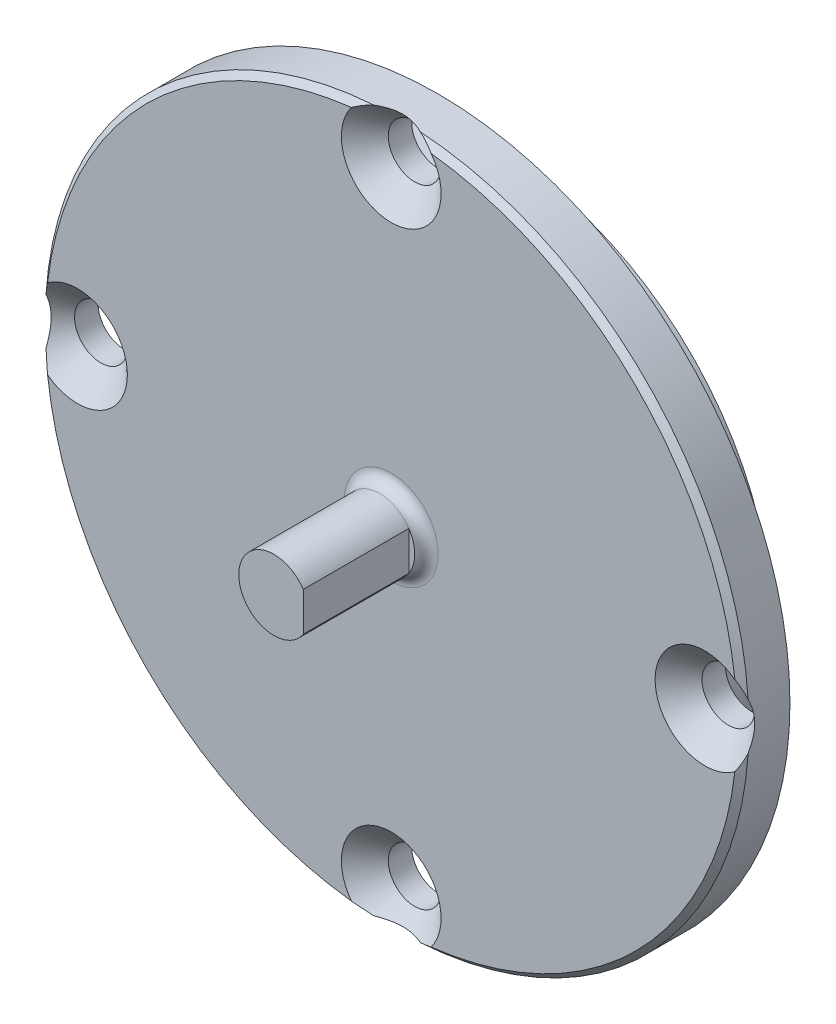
ISO-10303-21;
HEADER;
FILE_DESCRIPTION(('STEP AP214'),'2;1');
FILE_NAME('part.step','',(''),(''),'','','');
FILE_SCHEMA(('AUTOMOTIVE_DESIGN { 1 0 10303 214 1 1 1 1 }'));
ENDSEC;
DATA;
#1=APPLICATION_CONTEXT('core data for automotive mechanical design processes');
#2=APPLICATION_PROTOCOL_DEFINITION('international standard','automotive_design',2000,#1);
#3=PRODUCT_CONTEXT('',#1,'mechanical');
#4=PRODUCT('Part','Part','',(#3));
#5=PRODUCT_RELATED_PRODUCT_CATEGORY('part','',(#4));
#6=PRODUCT_DEFINITION_FORMATION('','',#4);
#7=PRODUCT_DEFINITION_CONTEXT('part definition',#1,'design');
#8=PRODUCT_DEFINITION('design','',#6,#7);
#9=PRODUCT_DEFINITION_SHAPE('','',#8);
#10=(LENGTH_UNIT() NAMED_UNIT(*) SI_UNIT(.MILLI.,.METRE.));
#11=(NAMED_UNIT(*) PLANE_ANGLE_UNIT() SI_UNIT($,.RADIAN.));
#12=(NAMED_UNIT(*) SI_UNIT($,.STERADIAN.) SOLID_ANGLE_UNIT());
#13=UNCERTAINTY_MEASURE_WITH_UNIT(LENGTH_MEASURE(1.E-05),#10,'distance_accuracy_value','');
#14=(GEOMETRIC_REPRESENTATION_CONTEXT(3) GLOBAL_UNCERTAINTY_ASSIGNED_CONTEXT((#13)) GLOBAL_UNIT_ASSIGNED_CONTEXT((#10,
#11,#12)) REPRESENTATION_CONTEXT('',''));
#15=CARTESIAN_POINT('',(0.,0.,0.));
#16=DIRECTION('',(0.,0.,1.));
#17=DIRECTION('',(1.,0.,0.));
#18=AXIS2_PLACEMENT_3D('',#15,#16,#17);
#19=CARTESIAN_POINT('',(0.,0.,4.));
#20=DIRECTION('',(0.,0.,1.));
#21=DIRECTION('',(1.,0.,0.));
#22=AXIS2_PLACEMENT_3D('',#19,#20,#21);
#23=PLANE('',#22);
#24=CARTESIAN_POINT('',(0.,0.,4.));
#25=DIRECTION('',(0.,0.,1.));
#26=DIRECTION('',(1.,0.,0.));
#27=AXIS2_PLACEMENT_3D('',#24,#25,#26);
#28=CIRCLE('',#27,4.);
#29=CARTESIAN_POINT('',(4.,0.,4.));
#30=VERTEX_POINT('',#29);
#31=EDGE_CURVE('E342',#30,#30,#28,.F.);
#32=ORIENTED_EDGE('',*,*,#31,.T.);
#33=EDGE_LOOP('',(#32));
#34=FACE_BOUND('',#33,.T.);
#35=CARTESIAN_POINT('',(0.,0.,4.));
#36=DIRECTION('',(0.,0.,1.));
#37=DIRECTION('',(1.,0.,0.));
#38=AXIS2_PLACEMENT_3D('',#35,#36,#37);
#39=CIRCLE('',#38,29.5);
#40=CARTESIAN_POINT('',(3.39719304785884,-29.303738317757,4.));
#41=VERTEX_POINT('',#40);
#42=CARTESIAN_POINT('',(29.303738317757,-3.39719304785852,4.));
#43=VERTEX_POINT('',#42);
#44=EDGE_CURVE('E121',#41,#43,#39,.T.);
#45=ORIENTED_EDGE('',*,*,#44,.T.);
#46=CARTESIAN_POINT('',(26.75,1.86641372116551E-13,4.));
#47=DIRECTION('',(0.,0.,1.));
#48=DIRECTION('',(1.,0.,0.));
#49=AXIS2_PLACEMENT_3D('',#46,#47,#48);
#50=CIRCLE('',#49,4.25);
#51=CARTESIAN_POINT('',(29.303738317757,3.39719304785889,4.));
#52=VERTEX_POINT('',#51);
#53=EDGE_CURVE('E44',#52,#43,#50,.T.);
#54=ORIENTED_EDGE('',*,*,#53,.F.);
#55=CARTESIAN_POINT('',(3.39719304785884,29.303738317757,4.));
#56=VERTEX_POINT('',#55);
#57=EDGE_CURVE('E118',#52,#56,#39,.T.);
#58=ORIENTED_EDGE('',*,*,#57,.T.);
#59=CARTESIAN_POINT('',(0.,26.75,4.));
#60=DIRECTION('',(0.,0.,1.));
#61=DIRECTION('',(1.,0.,0.));
#62=AXIS2_PLACEMENT_3D('',#59,#60,#61);
#63=CIRCLE('',#62,4.25);
#64=CARTESIAN_POINT('',(-3.39719304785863,29.303738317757,4.));
#65=VERTEX_POINT('',#64);
#66=EDGE_CURVE('E203',#65,#56,#63,.T.);
#67=ORIENTED_EDGE('',*,*,#66,.F.);
#68=CARTESIAN_POINT('',(-29.303738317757,3.39719304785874,4.));
#69=VERTEX_POINT('',#68);
#70=EDGE_CURVE('E129',#65,#69,#39,.T.);
#71=ORIENTED_EDGE('',*,*,#70,.T.);
#72=CARTESIAN_POINT('',(-26.75,0.,4.));
#73=DIRECTION('',(0.,0.,1.));
#74=DIRECTION('',(1.,0.,0.));
#75=AXIS2_PLACEMENT_3D('',#72,#73,#74);
#76=CIRCLE('',#75,4.25);
#77=CARTESIAN_POINT('',(-29.3037383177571,-3.39719304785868,4.));
#78=VERTEX_POINT('',#77);
#79=EDGE_CURVE('E143',#78,#69,#76,.T.);
#80=ORIENTED_EDGE('',*,*,#79,.F.);
#81=CARTESIAN_POINT('',(-3.39719304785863,-29.303738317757,4.));
#82=VERTEX_POINT('',#81);
#83=EDGE_CURVE('E130',#78,#82,#39,.T.);
#84=ORIENTED_EDGE('',*,*,#83,.T.);
#85=CARTESIAN_POINT('',(0.,-26.75,4.));
#86=DIRECTION('',(0.,0.,1.));
#87=DIRECTION('',(1.,0.,0.));
#88=AXIS2_PLACEMENT_3D('',#85,#86,#87);
#89=CIRCLE('',#88,4.25);
#90=EDGE_CURVE('E52',#41,#82,#89,.T.);
#91=ORIENTED_EDGE('',*,*,#90,.F.);
#92=EDGE_LOOP('',(#45,#54,#58,#67,#71,#80,#84,#91));
#93=FACE_BOUND('',#92,.T.);
#94=ADVANCED_FACE('F28',(#34,#93),#23,.T.);
#95=CARTESIAN_POINT('',(0.,0.,0.));
#96=DIRECTION('',(0.,0.,1.));
#97=DIRECTION('',(1.,0.,0.));
#98=AXIS2_PLACEMENT_3D('',#95,#96,#97);
#99=PLANE('',#98);
#100=CARTESIAN_POINT('',(0.,0.,0.));
#101=DIRECTION('',(0.,0.,1.));
#102=DIRECTION('',(1.,0.,0.));
#103=AXIS2_PLACEMENT_3D('',#100,#101,#102);
#104=CIRCLE('',#103,23.75);
#105=CARTESIAN_POINT('',(23.75,0.,0.));
#106=VERTEX_POINT('',#105);
#107=EDGE_CURVE('E11',#106,#106,#104,.T.);
#108=ORIENTED_EDGE('',*,*,#107,.T.);
#109=EDGE_LOOP('',(#108));
#110=FACE_BOUND('',#109,.T.);
#111=CARTESIAN_POINT('',(0.,-26.75,0.));
#112=DIRECTION('',(0.,0.,1.));
#113=DIRECTION('',(1.,0.,0.));
#114=AXIS2_PLACEMENT_3D('',#111,#112,#113);
#115=CIRCLE('',#114,2.25);
#116=CARTESIAN_POINT('',(2.25000000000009,-26.75,0.));
#117=VERTEX_POINT('',#116);
#118=EDGE_CURVE('E190',#117,#117,#115,.F.);
#119=ORIENTED_EDGE('',*,*,#118,.F.);
#120=EDGE_LOOP('',(#119));
#121=FACE_BOUND('',#120,.T.);
#122=CARTESIAN_POINT('',(0.,26.75,0.));
#123=DIRECTION('',(0.,0.,1.));
#124=DIRECTION('',(1.,0.,0.));
#125=AXIS2_PLACEMENT_3D('',#122,#123,#124);
#126=CIRCLE('',#125,2.25);
#127=CARTESIAN_POINT('',(2.25000000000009,26.75,0.));
#128=VERTEX_POINT('',#127);
#129=EDGE_CURVE('E224',#128,#128,#126,.F.);
#130=ORIENTED_EDGE('',*,*,#129,.F.);
#131=EDGE_LOOP('',(#130));
#132=FACE_BOUND('',#131,.T.);
#133=CARTESIAN_POINT('',(0.,0.,0.));
#134=DIRECTION('',(0.,0.,1.));
#135=DIRECTION('',(1.,0.,0.));
#136=AXIS2_PLACEMENT_3D('',#133,#134,#135);
#137=CIRCLE('',#136,30.);
#138=CARTESIAN_POINT('',(30.,0.,0.));
#139=VERTEX_POINT('',#138);
#140=EDGE_CURVE('E127',#139,#139,#137,.T.);
#141=ORIENTED_EDGE('',*,*,#140,.F.);
#142=EDGE_LOOP('',(#141));
#143=FACE_BOUND('',#142,.T.);
#144=CARTESIAN_POINT('',(-26.75,0.,0.));
#145=DIRECTION('',(0.,0.,1.));
#146=DIRECTION('',(1.,0.,0.));
#147=AXIS2_PLACEMENT_3D('',#144,#145,#146);
#148=CIRCLE('',#147,2.25);
#149=CARTESIAN_POINT('',(-24.5,0.,0.));
#150=VERTEX_POINT('',#149);
#151=EDGE_CURVE('E164',#150,#150,#148,.F.);
#152=ORIENTED_EDGE('',*,*,#151,.F.);
#153=EDGE_LOOP('',(#152));
#154=FACE_BOUND('',#153,.T.);
#155=CARTESIAN_POINT('',(26.75,1.86641372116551E-13,0.));
#156=DIRECTION('',(0.,0.,1.));
#157=DIRECTION('',(1.,0.,0.));
#158=AXIS2_PLACEMENT_3D('',#155,#156,#157);
#159=CIRCLE('',#158,2.25);
#160=CARTESIAN_POINT('',(29.,1.86641372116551E-13,0.));
#161=VERTEX_POINT('',#160);
#162=EDGE_CURVE('E361',#161,#161,#159,.F.);
#163=ORIENTED_EDGE('',*,*,#162,.F.);
#164=EDGE_LOOP('',(#163));
#165=FACE_BOUND('',#164,.T.);
#166=ADVANCED_FACE('F296',(#110,#121,#132,#143,#154,#165),#99,.F.);
#167=CARTESIAN_POINT('',(0.,0.,4.));
#168=DIRECTION('',(0.,0.,-1.));
#169=DIRECTION('',(-1.,0.,0.));
#170=AXIS2_PLACEMENT_3D('',#167,#168,#169);
#171=CYLINDRICAL_SURFACE('',#170,30.);
#172=ORIENTED_EDGE('',*,*,#140,.T.);
#173=EDGE_LOOP('',(#172));
#174=FACE_BOUND('',#173,.T.);
#175=CARTESIAN_POINT('',(29.9345514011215,-1.98056366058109,3.5002));
#176=CARTESIAN_POINT('',(29.9440210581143,-1.83742255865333,3.4327030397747));
#177=CARTESIAN_POINT('',(29.9526187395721,-1.6919002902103,3.36949670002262));
#178=CARTESIAN_POINT('',(29.9679024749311,-1.39535388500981,3.25470355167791));
#179=CARTESIAN_POINT('',(29.9745776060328,-1.24430360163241,3.2031834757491));
#180=CARTESIAN_POINT('',(29.9856393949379,-0.940275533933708,3.11640449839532));
#181=CARTESIAN_POINT('',(29.9900644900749,-0.787379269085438,3.08087375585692));
#182=CARTESIAN_POINT('',(29.9965765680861,-0.478675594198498,3.02816601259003));
#183=CARTESIAN_POINT('',(29.9986690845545,-0.322875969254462,3.01094557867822));
#184=CARTESIAN_POINT('',(30.0002890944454,-0.031314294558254,2.9976240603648));
#185=CARTESIAN_POINT('',(30.0001229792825,0.104332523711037,2.99900012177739));
#186=CARTESIAN_POINT('',(29.9979647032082,0.37470239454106,3.01672071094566));
#187=CARTESIAN_POINT('',(29.9959713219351,0.509424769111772,3.03307524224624));
#188=CARTESIAN_POINT('',(29.9902474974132,0.776480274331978,3.07938166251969));
#189=CARTESIAN_POINT('',(29.9865162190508,0.908812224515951,3.10934008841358));
#190=CARTESIAN_POINT('',(29.9774508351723,1.17028737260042,3.18076485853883));
#191=CARTESIAN_POINT('',(29.9721159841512,1.29942905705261,3.22223655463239));
#192=CARTESIAN_POINT('',(29.9615579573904,1.52117637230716,3.30250785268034));
#193=CARTESIAN_POINT('',(29.9566644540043,1.61457353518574,3.33921239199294));
#194=CARTESIAN_POINT('',(29.9461457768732,1.79912339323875,3.41677170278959));
#195=CARTESIAN_POINT('',(29.9405238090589,1.89028395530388,3.45760812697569));
#196=CARTESIAN_POINT('',(29.9345514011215,1.9805636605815,3.5002));
#197=B_SPLINE_CURVE_WITH_KNOTS('',3,(#175,#176,#177,#178,#179,#180,#181,#182,#183,#184,#185,
#186,#187,#188,#189,#190,#191,#192,#193,#194,#195,#196),.UNSPECIFIED.,.F.,.F.,(4,2,2,2,2,2,2,2,
2,2,4),(0.,0.475956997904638,0.9545670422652,1.4247004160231,1.8937160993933,2.29982480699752,
2.70620493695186,3.11278054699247,3.51954546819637,3.82084649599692,4.12086389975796),.UNSPECIFIED.);
#198=CARTESIAN_POINT('',(29.9345794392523,-1.98013984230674,3.5));
#199=VERTEX_POINT('',#198);
#200=CARTESIAN_POINT('',(29.9345794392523,1.98013984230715,3.5));
#201=VERTEX_POINT('',#200);
#202=EDGE_CURVE('E108',#199,#201,#197,.T.);
#203=ORIENTED_EDGE('',*,*,#202,.F.);
#204=CARTESIAN_POINT('',(0.,0.,3.5));
#205=DIRECTION('',(0.,0.,1.));
#206=DIRECTION('',(1.,0.,0.));
#207=AXIS2_PLACEMENT_3D('',#204,#205,#206);
#208=CIRCLE('',#207,30.);
#209=CARTESIAN_POINT('',(1.98013984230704,-29.9345794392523,3.5));
#210=VERTEX_POINT('',#209);
#211=EDGE_CURVE('E343',#199,#210,#208,.F.);
#212=ORIENTED_EDGE('',*,*,#211,.T.);
#213=CARTESIAN_POINT('',(-1.9805636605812,-29.9345514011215,3.5002));
#214=CARTESIAN_POINT('',(-1.83742255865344,-29.9440210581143,3.43270303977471));
#215=CARTESIAN_POINT('',(-1.6919002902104,-29.9526187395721,3.36949670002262));
#216=CARTESIAN_POINT('',(-1.39535388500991,-29.9679024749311,3.25470355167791));
#217=CARTESIAN_POINT('',(-1.24430360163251,-29.9745776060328,3.2031834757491));
#218=CARTESIAN_POINT('',(-0.940275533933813,-29.9856393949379,3.11640449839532));
#219=CARTESIAN_POINT('',(-0.787379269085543,-29.9900644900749,3.08087375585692));
#220=CARTESIAN_POINT('',(-0.478675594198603,-29.996576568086,3.02816601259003));
#221=CARTESIAN_POINT('',(-0.322875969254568,-29.9986690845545,3.01094557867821));
#222=CARTESIAN_POINT('',(-0.0313142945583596,-30.0002890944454,2.9976240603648));
#223=CARTESIAN_POINT('',(0.104332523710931,-30.0001229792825,2.99900012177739));
#224=CARTESIAN_POINT('',(0.374702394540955,-29.9979647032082,3.01672071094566));
#225=CARTESIAN_POINT('',(0.509424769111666,-29.9959713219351,3.03307524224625));
#226=CARTESIAN_POINT('',(0.776480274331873,-29.9902474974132,3.07938166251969));
#227=CARTESIAN_POINT('',(0.908812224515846,-29.9865162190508,3.10934008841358));
#228=CARTESIAN_POINT('',(1.17028737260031,-29.9774508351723,3.18076485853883));
#229=CARTESIAN_POINT('',(1.2994290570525,-29.9721159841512,3.2222365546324));
#230=CARTESIAN_POINT('',(1.52117637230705,-29.9615579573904,3.30250785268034));
#231=CARTESIAN_POINT('',(1.61457353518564,-29.9566644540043,3.33921239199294));
#232=CARTESIAN_POINT('',(1.79912339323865,-29.9461457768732,3.41677170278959));
#233=CARTESIAN_POINT('',(1.89028395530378,-29.9405238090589,3.45760812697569));
#234=CARTESIAN_POINT('',(1.9805636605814,-29.9345514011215,3.50020000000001));
#235=B_SPLINE_CURVE_WITH_KNOTS('',3,(#213,#214,#215,#216,#217,#218,#219,#220,#221,#222,#223,
#224,#225,#226,#227,#228,#229,#230,#231,#232,#233,#234),.UNSPECIFIED.,.F.,.F.,(4,2,2,2,2,2,2,2,
2,2,4),(0.,0.475956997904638,0.9545670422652,1.4247004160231,1.8937160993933,2.29982480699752,
2.70620493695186,3.11278054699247,3.51954546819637,3.82084649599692,4.12086389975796),.UNSPECIFIED.);
#236=CARTESIAN_POINT('',(-1.98013984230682,-29.9345794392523,3.49999999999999));
#237=VERTEX_POINT('',#236);
#238=EDGE_CURVE('E184',#237,#210,#235,.T.);
#239=ORIENTED_EDGE('',*,*,#238,.F.);
#240=CARTESIAN_POINT('',(-29.9345794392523,-1.98013984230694,3.5));
#241=VERTEX_POINT('',#240);
#242=EDGE_CURVE('E139',#237,#241,#208,.F.);
#243=ORIENTED_EDGE('',*,*,#242,.T.);
#244=CARTESIAN_POINT('',(-29.9345514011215,1.9805636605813,3.5002));
#245=CARTESIAN_POINT('',(-29.9440210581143,1.83742255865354,3.43270303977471));
#246=CARTESIAN_POINT('',(-29.9526187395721,1.6919002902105,3.36949670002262));
#247=CARTESIAN_POINT('',(-29.9679024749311,1.39535388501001,3.25470355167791));
#248=CARTESIAN_POINT('',(-29.9745776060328,1.24430360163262,3.2031834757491));
#249=CARTESIAN_POINT('',(-29.9856393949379,0.940275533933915,3.11640449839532));
#250=CARTESIAN_POINT('',(-29.9900644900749,0.787379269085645,3.08087375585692));
#251=CARTESIAN_POINT('',(-29.996576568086,0.478675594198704,3.02816601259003));
#252=CARTESIAN_POINT('',(-29.9986690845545,0.322875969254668,3.01094557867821));
#253=CARTESIAN_POINT('',(-30.0002890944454,0.03131429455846,2.9976240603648));
#254=CARTESIAN_POINT('',(-30.0001229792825,-0.104332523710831,2.99900012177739));
#255=CARTESIAN_POINT('',(-29.9979647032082,-0.374702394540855,3.01672071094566));
#256=CARTESIAN_POINT('',(-29.9959713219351,-0.509424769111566,3.03307524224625));
#257=CARTESIAN_POINT('',(-29.9902474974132,-0.776480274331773,3.0793816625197));
#258=CARTESIAN_POINT('',(-29.9865162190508,-0.908812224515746,3.10934008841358));
#259=CARTESIAN_POINT('',(-29.9774508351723,-1.17028737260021,3.18076485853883));
#260=CARTESIAN_POINT('',(-29.9721159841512,-1.2994290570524,3.2222365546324));
#261=CARTESIAN_POINT('',(-29.9615579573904,-1.52117637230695,3.30250785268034));
#262=CARTESIAN_POINT('',(-29.9566644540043,-1.61457353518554,3.33921239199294));
#263=CARTESIAN_POINT('',(-29.9461457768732,-1.79912339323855,3.41677170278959));
#264=CARTESIAN_POINT('',(-29.9405238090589,-1.89028395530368,3.45760812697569));
#265=CARTESIAN_POINT('',(-29.9345514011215,-1.9805636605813,3.50020000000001));
#266=B_SPLINE_CURVE_WITH_KNOTS('',3,(#244,#245,#246,#247,#248,#249,#250,#251,#252,#253,#254,
#255,#256,#257,#258,#259,#260,#261,#262,#263,#264,#265),.UNSPECIFIED.,.F.,.F.,(4,2,2,2,2,2,2,2,
2,2,4),(0.,0.475956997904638,0.954567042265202,1.4247004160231,1.8937160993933,2.29982480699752,
2.70620493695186,3.11278054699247,3.51954546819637,3.82084649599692,4.12086389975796),.UNSPECIFIED.);
#267=CARTESIAN_POINT('',(-29.9345794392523,1.98013984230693,3.49999999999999));
#268=VERTEX_POINT('',#267);
#269=EDGE_CURVE('E197',#268,#241,#266,.T.);
#270=ORIENTED_EDGE('',*,*,#269,.F.);
#271=CARTESIAN_POINT('',(-1.98013984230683,29.9345794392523,3.5));
#272=VERTEX_POINT('',#271);
#273=EDGE_CURVE('E136',#268,#272,#208,.F.);
#274=ORIENTED_EDGE('',*,*,#273,.T.);
#275=CARTESIAN_POINT('',(1.9805636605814,29.9345514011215,3.5002));
#276=CARTESIAN_POINT('',(1.83742255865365,29.9440210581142,3.4327030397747));
#277=CARTESIAN_POINT('',(1.69190029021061,29.9526187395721,3.36949670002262));
#278=CARTESIAN_POINT('',(1.39535388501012,29.9679024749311,3.25470355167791));
#279=CARTESIAN_POINT('',(1.24430360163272,29.9745776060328,3.2031834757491));
#280=CARTESIAN_POINT('',(0.940275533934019,29.9856393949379,3.11640449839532));
#281=CARTESIAN_POINT('',(0.78737926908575,29.9900644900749,3.08087375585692));
#282=CARTESIAN_POINT('',(0.478675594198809,29.996576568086,3.02816601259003));
#283=CARTESIAN_POINT('',(0.322875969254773,29.9986690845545,3.01094557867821));
#284=CARTESIAN_POINT('',(0.0313142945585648,30.0002890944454,2.9976240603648));
#285=CARTESIAN_POINT('',(-0.104332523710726,30.0001229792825,2.99900012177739));
#286=CARTESIAN_POINT('',(-0.374702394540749,29.9979647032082,3.01672071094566));
#287=CARTESIAN_POINT('',(-0.509424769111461,29.9959713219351,3.03307524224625));
#288=CARTESIAN_POINT('',(-0.776480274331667,29.9902474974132,3.07938166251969));
#289=CARTESIAN_POINT('',(-0.908812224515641,29.9865162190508,3.10934008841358));
#290=CARTESIAN_POINT('',(-1.1702873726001,29.9774508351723,3.18076485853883));
#291=CARTESIAN_POINT('',(-1.2994290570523,29.9721159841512,3.2222365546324));
#292=CARTESIAN_POINT('',(-1.52117637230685,29.9615579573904,3.30250785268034));
#293=CARTESIAN_POINT('',(-1.61457353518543,29.9566644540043,3.33921239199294));
#294=CARTESIAN_POINT('',(-1.79912339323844,29.9461457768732,3.41677170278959));
#295=CARTESIAN_POINT('',(-1.89028395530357,29.9405238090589,3.45760812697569));
#296=CARTESIAN_POINT('',(-1.98056366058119,29.9345514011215,3.50020000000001));
#297=B_SPLINE_CURVE_WITH_KNOTS('',3,(#275,#276,#277,#278,#279,#280,#281,#282,#283,#284,#285,
#286,#287,#288,#289,#290,#291,#292,#293,#294,#295,#296),.UNSPECIFIED.,.F.,.F.,(4,2,2,2,2,2,2,2,
2,2,4),(0.,0.475956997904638,0.954567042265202,1.4247004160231,1.8937160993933,2.29982480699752,
2.70620493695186,3.11278054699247,3.51954546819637,3.82084649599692,4.12086389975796),.UNSPECIFIED.);
#298=CARTESIAN_POINT('',(1.98013984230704,29.9345794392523,3.5));
#299=VERTEX_POINT('',#298);
#300=EDGE_CURVE('E228',#299,#272,#297,.T.);
#301=ORIENTED_EDGE('',*,*,#300,.F.);
#302=EDGE_CURVE('E140',#299,#201,#208,.F.);
#303=ORIENTED_EDGE('',*,*,#302,.T.);
#304=EDGE_LOOP('',(#203,#212,#239,#243,#270,#274,#301,#303));
#305=FACE_BOUND('',#304,.T.);
#306=ADVANCED_FACE('F30',(#174,#305),#171,.T.);
#307=CARTESIAN_POINT('',(0.,0.,4.));
#308=DIRECTION('',(0.,0.,-1.));
#309=DIRECTION('',(-1.,0.,0.));
#310=AXIS2_PLACEMENT_3D('',#307,#308,#309);
#311=CONICAL_SURFACE('',#310,29.5,0.785398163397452);
#312=ORIENTED_EDGE('',*,*,#57,.F.);
#313=CARTESIAN_POINT('',(29.3034859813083,3.39763290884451,4.00020000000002));
#314=CARTESIAN_POINT('',(29.3666502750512,3.28753357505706,3.95013644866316));
#315=CARTESIAN_POINT('',(29.4275878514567,3.17531252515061,3.90183777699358));
#316=CARTESIAN_POINT('',(29.544208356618,2.94710187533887,3.80940522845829));
#317=CARTESIAN_POINT('',(29.5999097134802,2.8311275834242,3.76525674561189));
#318=CARTESIAN_POINT('',(29.705758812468,2.59500870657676,3.68136153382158));
#319=CARTESIAN_POINT('',(29.7559032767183,2.47486171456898,3.64161740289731));
#320=CARTESIAN_POINT('',(29.8501422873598,2.23022303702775,3.56692426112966));
#321=CARTESIAN_POINT('',(29.8942139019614,2.10571699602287,3.53199342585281));
#322=CARTESIAN_POINT('',(29.9348317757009,1.97935509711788,3.4998));
#323=B_SPLINE_CURVE_WITH_KNOTS('',3,(#313,#314,#315,#316,#317,#318,#319,#320,#321,#322),
.UNSPECIFIED.,.F.,.F.,(4,2,2,2,4),(0.,0.409345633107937,0.817192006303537,1.22527769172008,
1.63486443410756),.UNSPECIFIED.);
#324=EDGE_CURVE('E104',#52,#201,#323,.T.);
#325=ORIENTED_EDGE('',*,*,#324,.T.);
#326=ORIENTED_EDGE('',*,*,#302,.F.);
#327=CARTESIAN_POINT('',(1.97935509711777,29.9348317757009,3.4998));
#328=CARTESIAN_POINT('',(2.10571699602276,29.8942139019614,3.53199342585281));
#329=CARTESIAN_POINT('',(2.23022303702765,29.8501422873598,3.56692426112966));
#330=CARTESIAN_POINT('',(2.47486171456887,29.7559032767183,3.64161740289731));
#331=CARTESIAN_POINT('',(2.59500870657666,29.705758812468,3.68136153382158));
#332=CARTESIAN_POINT('',(2.8311275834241,29.5999097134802,3.76525674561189));
#333=CARTESIAN_POINT('',(2.94710187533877,29.544208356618,3.80940522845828));
#334=CARTESIAN_POINT('',(3.17531252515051,29.4275878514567,3.90183777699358));
#335=CARTESIAN_POINT('',(3.28753357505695,29.3666502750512,3.95013644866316));
#336=CARTESIAN_POINT('',(3.39763290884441,29.3034859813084,4.00020000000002));
#337=B_SPLINE_CURVE_WITH_KNOTS('',3,(#327,#328,#329,#330,#331,#332,#333,#334,#335,#336),
.UNSPECIFIED.,.F.,.F.,(4,2,2,2,4),(0.,0.409586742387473,0.817672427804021,1.22551880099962,
1.63486443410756),.UNSPECIFIED.);
#338=EDGE_CURVE('E126',#299,#56,#337,.T.);
#339=ORIENTED_EDGE('',*,*,#338,.T.);
#340=EDGE_LOOP('',(#312,#325,#326,#339));
#341=FACE_BOUND('',#340,.T.);
#342=ADVANCED_FACE('F125',(#341),#311,.T.);
#343=ORIENTED_EDGE('',*,*,#211,.F.);
#344=CARTESIAN_POINT('',(29.9348317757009,-1.97935509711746,3.4998));
#345=CARTESIAN_POINT('',(29.8942139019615,-2.10571699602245,3.53199342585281));
#346=CARTESIAN_POINT('',(29.8501422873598,-2.23022303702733,3.56692426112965));
#347=CARTESIAN_POINT('',(29.7559032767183,-2.47486171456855,3.6416174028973));
#348=CARTESIAN_POINT('',(29.705758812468,-2.59500870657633,3.68136153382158));
#349=CARTESIAN_POINT('',(29.5999097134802,-2.83112758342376,3.76525674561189));
#350=CARTESIAN_POINT('',(29.544208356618,-2.94710187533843,3.80940522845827));
#351=CARTESIAN_POINT('',(29.4275878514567,-3.17531252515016,3.90183777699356));
#352=CARTESIAN_POINT('',(29.3666502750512,-3.2875335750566,3.95013644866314));
#353=CARTESIAN_POINT('',(29.3034859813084,-3.39763290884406,4.0002));
#354=B_SPLINE_CURVE_WITH_KNOTS('',3,(#344,#345,#346,#347,#348,#349,#350,#351,#352,#353),
.UNSPECIFIED.,.F.,.F.,(4,2,2,2,4),(0.,0.40958674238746,0.817672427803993,1.22551880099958,
1.6348644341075),.UNSPECIFIED.);
#355=EDGE_CURVE('E113',#199,#43,#354,.T.);
#356=ORIENTED_EDGE('',*,*,#355,.T.);
#357=ORIENTED_EDGE('',*,*,#44,.F.);
#358=CARTESIAN_POINT('',(3.39763290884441,-29.3034859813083,4.0002));
#359=CARTESIAN_POINT('',(3.28753357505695,-29.3666502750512,3.95013644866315));
#360=CARTESIAN_POINT('',(3.17531252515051,-29.4275878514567,3.90183777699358));
#361=CARTESIAN_POINT('',(2.94710187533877,-29.544208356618,3.80940522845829));
#362=CARTESIAN_POINT('',(2.83112758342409,-29.5999097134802,3.76525674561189));
#363=CARTESIAN_POINT('',(2.59500870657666,-29.705758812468,3.68136153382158));
#364=CARTESIAN_POINT('',(2.47486171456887,-29.7559032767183,3.64161740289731));
#365=CARTESIAN_POINT('',(2.23022303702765,-29.8501422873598,3.56692426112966));
#366=CARTESIAN_POINT('',(2.10571699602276,-29.8942139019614,3.53199342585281));
#367=CARTESIAN_POINT('',(1.97935509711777,-29.9348317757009,3.4998));
#368=B_SPLINE_CURVE_WITH_KNOTS('',3,(#358,#359,#360,#361,#362,#363,#364,#365,#366,#367),
.UNSPECIFIED.,.F.,.F.,(4,2,2,2,4),(0.,0.409345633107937,0.817192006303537,1.22527769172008,
1.63486443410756),.UNSPECIFIED.);
#369=EDGE_CURVE('E152',#41,#210,#368,.T.);
#370=ORIENTED_EDGE('',*,*,#369,.T.);
#371=EDGE_LOOP('',(#343,#356,#357,#370));
#372=FACE_BOUND('',#371,.T.);
#373=ADVANCED_FACE('F468',(#372),#311,.T.);
#374=ORIENTED_EDGE('',*,*,#242,.F.);
#375=CARTESIAN_POINT('',(-1.97935509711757,-29.9348317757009,3.4998));
#376=CARTESIAN_POINT('',(-2.10571699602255,-29.8942139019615,3.53199342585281));
#377=CARTESIAN_POINT('',(-2.23022303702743,-29.8501422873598,3.56692426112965));
#378=CARTESIAN_POINT('',(-2.47486171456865,-29.7559032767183,3.6416174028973));
#379=CARTESIAN_POINT('',(-2.59500870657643,-29.705758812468,3.68136153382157));
#380=CARTESIAN_POINT('',(-2.83112758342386,-29.5999097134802,3.76525674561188));
#381=CARTESIAN_POINT('',(-2.94710187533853,-29.544208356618,3.80940522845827));
#382=CARTESIAN_POINT('',(-3.17531252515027,-29.4275878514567,3.90183777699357));
#383=CARTESIAN_POINT('',(-3.28753357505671,-29.3666502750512,3.95013644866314));
#384=CARTESIAN_POINT('',(-3.39763290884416,-29.3034859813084,4.0002));
#385=B_SPLINE_CURVE_WITH_KNOTS('',3,(#375,#376,#377,#378,#379,#380,#381,#382,#383,#384),
.UNSPECIFIED.,.F.,.F.,(4,2,2,2,4),(0.,0.40958674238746,0.817672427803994,1.22551880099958,
1.6348644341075),.UNSPECIFIED.);
#386=EDGE_CURVE('E149',#237,#82,#385,.T.);
#387=ORIENTED_EDGE('',*,*,#386,.T.);
#388=ORIENTED_EDGE('',*,*,#83,.F.);
#389=CARTESIAN_POINT('',(-29.3034859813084,-3.39763290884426,4.0002));
#390=CARTESIAN_POINT('',(-29.3666502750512,-3.28753357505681,3.95013644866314));
#391=CARTESIAN_POINT('',(-29.4275878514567,-3.17531252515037,3.90183777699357));
#392=CARTESIAN_POINT('',(-29.544208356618,-2.94710187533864,3.80940522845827));
#393=CARTESIAN_POINT('',(-29.5999097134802,-2.83112758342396,3.76525674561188));
#394=CARTESIAN_POINT('',(-29.705758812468,-2.59500870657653,3.68136153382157));
#395=CARTESIAN_POINT('',(-29.7559032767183,-2.47486171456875,3.6416174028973));
#396=CARTESIAN_POINT('',(-29.8501422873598,-2.23022303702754,3.56692426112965));
#397=CARTESIAN_POINT('',(-29.8942139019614,-2.10571699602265,3.53199342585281));
#398=CARTESIAN_POINT('',(-29.9348317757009,-1.97935509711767,3.4998));
#399=B_SPLINE_CURVE_WITH_KNOTS('',3,(#389,#390,#391,#392,#393,#394,#395,#396,#397,#398),
.UNSPECIFIED.,.F.,.F.,(4,2,2,2,4),(0.,0.409345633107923,0.817192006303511,1.22527769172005,
1.63486443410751),.UNSPECIFIED.);
#400=EDGE_CURVE('E148',#78,#241,#399,.T.);
#401=ORIENTED_EDGE('',*,*,#400,.T.);
#402=EDGE_LOOP('',(#374,#387,#388,#401));
#403=FACE_BOUND('',#402,.T.);
#404=ADVANCED_FACE('F147',(#403),#311,.T.);
#405=ORIENTED_EDGE('',*,*,#273,.F.);
#406=CARTESIAN_POINT('',(-29.9348317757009,1.97935509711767,3.4998));
#407=CARTESIAN_POINT('',(-29.8942139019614,2.10571699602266,3.53199342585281));
#408=CARTESIAN_POINT('',(-29.8501422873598,2.23022303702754,3.56692426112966));
#409=CARTESIAN_POINT('',(-29.7559032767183,2.47486171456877,3.64161740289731));
#410=CARTESIAN_POINT('',(-29.705758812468,2.59500870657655,3.68136153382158));
#411=CARTESIAN_POINT('',(-29.5999097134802,2.83112758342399,3.76525674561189));
#412=CARTESIAN_POINT('',(-29.544208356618,2.94710187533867,3.80940522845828));
#413=CARTESIAN_POINT('',(-29.4275878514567,3.1753125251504,3.90183777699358));
#414=CARTESIAN_POINT('',(-29.3666502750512,3.28753357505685,3.95013644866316));
#415=CARTESIAN_POINT('',(-29.3034859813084,3.39763290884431,4.00020000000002));
#416=B_SPLINE_CURVE_WITH_KNOTS('',3,(#406,#407,#408,#409,#410,#411,#412,#413,#414,#415),
.UNSPECIFIED.,.F.,.F.,(4,2,2,2,4),(0.,0.409586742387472,0.817672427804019,1.22551880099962,
1.63486443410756),.UNSPECIFIED.);
#417=EDGE_CURVE('E156',#268,#69,#416,.T.);
#418=ORIENTED_EDGE('',*,*,#417,.T.);
#419=ORIENTED_EDGE('',*,*,#70,.F.);
#420=CARTESIAN_POINT('',(-3.39763290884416,29.3034859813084,4.0002));
#421=CARTESIAN_POINT('',(-3.28753357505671,29.3666502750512,3.95013644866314));
#422=CARTESIAN_POINT('',(-3.17531252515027,29.4275878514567,3.90183777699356));
#423=CARTESIAN_POINT('',(-2.94710187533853,29.544208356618,3.80940522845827));
#424=CARTESIAN_POINT('',(-2.83112758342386,29.5999097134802,3.76525674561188));
#425=CARTESIAN_POINT('',(-2.59500870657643,29.705758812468,3.68136153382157));
#426=CARTESIAN_POINT('',(-2.47486171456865,29.7559032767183,3.6416174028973));
#427=CARTESIAN_POINT('',(-2.23022303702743,29.8501422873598,3.56692426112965));
#428=CARTESIAN_POINT('',(-2.10571699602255,29.8942139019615,3.53199342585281));
#429=CARTESIAN_POINT('',(-1.97935509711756,29.9348317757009,3.4998));
#430=B_SPLINE_CURVE_WITH_KNOTS('',3,(#420,#421,#422,#423,#424,#425,#426,#427,#428,#429),
.UNSPECIFIED.,.F.,.F.,(4,2,2,2,4),(0.,0.409345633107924,0.817192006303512,1.22527769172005,
1.63486443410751),.UNSPECIFIED.);
#431=EDGE_CURVE('E223',#65,#272,#430,.T.);
#432=ORIENTED_EDGE('',*,*,#431,.T.);
#433=EDGE_LOOP('',(#405,#418,#419,#432));
#434=FACE_BOUND('',#433,.T.);
#435=ADVANCED_FACE('F291',(#434),#311,.T.);
#436=CARTESIAN_POINT('',(0.,0.,-5.));
#437=DIRECTION('',(0.,0.,-1.));
#438=DIRECTION('',(-1.,0.,0.));
#439=AXIS2_PLACEMENT_3D('',#436,#437,#438);
#440=PLANE('',#439);
#441=CARTESIAN_POINT('',(0.,0.,-5.));
#442=DIRECTION('',(0.,0.,-1.));
#443=DIRECTION('',(-1.,0.,0.));
#444=AXIS2_PLACEMENT_3D('',#441,#442,#443);
#445=CIRCLE('',#444,23.45);
#446=CARTESIAN_POINT('',(-23.45,0.,-5.));
#447=VERTEX_POINT('',#446);
#448=EDGE_CURVE('E132',#447,#447,#445,.T.);
#449=ORIENTED_EDGE('',*,*,#448,.T.);
#450=EDGE_LOOP('',(#449));
#451=FACE_BOUND('',#450,.T.);
#452=CARTESIAN_POINT('',(0.,0.,-5.));
#453=DIRECTION('',(0.,0.,-1.));
#454=DIRECTION('',(-1.,0.,0.));
#455=AXIS2_PLACEMENT_3D('',#452,#453,#454);
#456=CIRCLE('',#455,19.);
#457=CARTESIAN_POINT('',(-19.,0.,-5.));
#458=VERTEX_POINT('',#457);
#459=EDGE_CURVE('E271',#458,#458,#456,.T.);
#460=ORIENTED_EDGE('',*,*,#459,.F.);
#461=EDGE_LOOP('',(#460));
#462=FACE_BOUND('',#461,.T.);
#463=ADVANCED_FACE('F277',(#451,#462),#440,.T.);
#464=CARTESIAN_POINT('',(0.,0.,-5.));
#465=DIRECTION('',(0.,0.,1.));
#466=DIRECTION('',(1.,0.,0.));
#467=AXIS2_PLACEMENT_3D('',#464,#465,#466);
#468=CYLINDRICAL_SURFACE('',#467,23.45);
#469=CARTESIAN_POINT('',(0.,0.,-0.3));
#470=DIRECTION('',(0.,0.,1.));
#471=DIRECTION('',(1.,0.,0.));
#472=AXIS2_PLACEMENT_3D('',#469,#470,#471);
#473=CIRCLE('',#472,23.45);
#474=CARTESIAN_POINT('',(23.45,0.,-0.3));
#475=VERTEX_POINT('',#474);
#476=EDGE_CURVE('E37',#475,#475,#473,.F.);
#477=ORIENTED_EDGE('',*,*,#476,.T.);
#478=EDGE_LOOP('',(#477));
#479=FACE_BOUND('',#478,.T.);
#480=ORIENTED_EDGE('',*,*,#448,.F.);
#481=EDGE_LOOP('',(#480));
#482=FACE_BOUND('',#481,.T.);
#483=ADVANCED_FACE('F280',(#479,#482),#468,.T.);
#484=CARTESIAN_POINT('',(0.,0.,-5.));
#485=DIRECTION('',(0.,0.,1.));
#486=DIRECTION('',(1.,0.,0.));
#487=AXIS2_PLACEMENT_3D('',#484,#485,#486);
#488=CYLINDRICAL_SURFACE('',#487,19.);
#489=ORIENTED_EDGE('',*,*,#459,.T.);
#490=EDGE_LOOP('',(#489));
#491=FACE_BOUND('',#490,.T.);
#492=CARTESIAN_POINT('',(0.,0.,0.));
#493=DIRECTION('',(0.,0.,-1.));
#494=DIRECTION('',(-1.,0.,0.));
#495=AXIS2_PLACEMENT_3D('',#492,#493,#494);
#496=CIRCLE('',#495,19.);
#497=CARTESIAN_POINT('',(-19.,0.,0.));
#498=VERTEX_POINT('',#497);
#499=EDGE_CURVE('E268',#498,#498,#496,.T.);
#500=ORIENTED_EDGE('',*,*,#499,.F.);
#501=EDGE_LOOP('',(#500));
#502=FACE_BOUND('',#501,.T.);
#503=ADVANCED_FACE('F282',(#491,#502),#488,.F.);
#504=ORIENTED_EDGE('',*,*,#499,.T.);
#505=EDGE_LOOP('',(#504));
#506=FACE_BOUND('',#505,.T.);
#507=ADVANCED_FACE('F289',(#506),#99,.F.);
#508=CARTESIAN_POINT('',(0.,0.,14.));
#509=DIRECTION('',(0.,0.,-1.));
#510=DIRECTION('',(-1.,0.,0.));
#511=AXIS2_PLACEMENT_3D('',#508,#509,#510);
#512=CYLINDRICAL_SURFACE('',#511,3.);
#513=CARTESIAN_POINT('',(0.,0.,14.));
#514=DIRECTION('',(0.,0.,1.));
#515=DIRECTION('',(1.,0.,0.));
#516=AXIS2_PLACEMENT_3D('',#513,#514,#515);
#517=CIRCLE('',#516,3.);
#518=CARTESIAN_POINT('',(2.5,1.65831239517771,14.));
#519=VERTEX_POINT('',#518);
#520=CARTESIAN_POINT('',(2.5,-1.65831239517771,14.));
#521=VERTEX_POINT('',#520);
#522=EDGE_CURVE('E265',#519,#521,#517,.T.);
#523=ORIENTED_EDGE('',*,*,#522,.F.);
#524=DIRECTION('',(0.,0.,-1.));
#525=VECTOR('',#524,1.);
#526=CARTESIAN_POINT('',(2.5,1.65831239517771,14.));
#527=LINE('',#526,#525);
#528=CARTESIAN_POINT('',(2.5,1.65831239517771,5.));
#529=VERTEX_POINT('',#528);
#530=EDGE_CURVE('E262',#519,#529,#527,.T.);
#531=ORIENTED_EDGE('',*,*,#530,.T.);
#532=CARTESIAN_POINT('',(0.,0.,5.));
#533=DIRECTION('',(0.,0.,1.));
#534=DIRECTION('',(1.,0.,0.));
#535=AXIS2_PLACEMENT_3D('',#532,#533,#534);
#536=CIRCLE('',#535,3.);
#537=CARTESIAN_POINT('',(2.5,-1.65831239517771,5.));
#538=VERTEX_POINT('',#537);
#539=EDGE_CURVE('E339',#529,#538,#536,.T.);
#540=ORIENTED_EDGE('',*,*,#539,.T.);
#541=DIRECTION('',(0.,0.,-1.));
#542=VECTOR('',#541,1.);
#543=CARTESIAN_POINT('',(2.5,-1.65831239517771,14.));
#544=LINE('',#543,#542);
#545=EDGE_CURVE('E257',#538,#521,#544,.F.);
#546=ORIENTED_EDGE('',*,*,#545,.T.);
#547=EDGE_LOOP('',(#523,#531,#540,#546));
#548=FACE_BOUND('',#547,.T.);
#549=ADVANCED_FACE('F304',(#548),#512,.T.);
#550=CARTESIAN_POINT('',(0.,0.,14.));
#551=DIRECTION('',(0.,0.,1.));
#552=DIRECTION('',(1.,0.,0.));
#553=AXIS2_PLACEMENT_3D('',#550,#551,#552);
#554=PLANE('',#553);
#555=DIRECTION('',(0.,1.,0.));
#556=VECTOR('',#555,1.);
#557=CARTESIAN_POINT('',(2.5,-30.,14.));
#558=LINE('',#557,#556);
#559=EDGE_CURVE('E227',#521,#519,#558,.T.);
#560=ORIENTED_EDGE('',*,*,#559,.T.);
#561=ORIENTED_EDGE('',*,*,#522,.T.);
#562=EDGE_LOOP('',(#560,#561));
#563=FACE_BOUND('',#562,.T.);
#564=ADVANCED_FACE('F309',(#563),#554,.T.);
#565=CARTESIAN_POINT('',(0.,0.,5.));
#566=DIRECTION('',(0.,0.,1.));
#567=DIRECTION('',(1.,0.,0.));
#568=AXIS2_PLACEMENT_3D('',#565,#566,#567);
#569=TOROIDAL_SURFACE('',#568,4.,1.);
#570=ORIENTED_EDGE('',*,*,#31,.F.);
#571=EDGE_LOOP('',(#570));
#572=FACE_BOUND('',#571,.T.);
#573=EDGE_CURVE('E336',#538,#529,#536,.T.);
#574=ORIENTED_EDGE('',*,*,#573,.F.);
#575=ORIENTED_EDGE('',*,*,#539,.F.);
#576=EDGE_LOOP('',(#574,#575));
#577=FACE_BOUND('',#576,.T.);
#578=ADVANCED_FACE('F316',(#572,#577),#569,.F.);
#579=CARTESIAN_POINT('',(2.5,-30.,5.));
#580=DIRECTION('',(-1.,0.,0.));
#581=DIRECTION('',(0.,0.,1.));
#582=AXIS2_PLACEMENT_3D('',#579,#580,#581);
#583=PLANE('',#582);
#584=ORIENTED_EDGE('',*,*,#559,.F.);
#585=ORIENTED_EDGE('',*,*,#545,.F.);
#586=DIRECTION('',(0.,1.,0.));
#587=VECTOR('',#586,1.);
#588=CARTESIAN_POINT('',(2.5,-30.,5.));
#589=LINE('',#588,#587);
#590=EDGE_CURVE('E254',#538,#529,#589,.T.);
#591=ORIENTED_EDGE('',*,*,#590,.T.);
#592=ORIENTED_EDGE('',*,*,#530,.F.);
#593=EDGE_LOOP('',(#584,#585,#591,#592));
#594=FACE_BOUND('',#593,.T.);
#595=ADVANCED_FACE('F323',(#594),#583,.F.);
#596=CARTESIAN_POINT('',(2.5,-30.,5.));
#597=DIRECTION('',(0.,0.,1.));
#598=DIRECTION('',(1.,0.,0.));
#599=AXIS2_PLACEMENT_3D('',#596,#597,#598);
#600=PLANE('',#599);
#601=ORIENTED_EDGE('',*,*,#590,.F.);
#602=ORIENTED_EDGE('',*,*,#573,.T.);
#603=EDGE_LOOP('',(#601,#602));
#604=FACE_BOUND('',#603,.T.);
#605=ADVANCED_FACE('F326',(#604),#600,.T.);
#606=CARTESIAN_POINT('',(0.,26.75,4.));
#607=DIRECTION('',(0.,0.,1.));
#608=DIRECTION('',(1.,0.,0.));
#609=AXIS2_PLACEMENT_3D('',#606,#607,#608);
#610=CYLINDRICAL_SURFACE('',#609,2.25);
#611=CARTESIAN_POINT('',(0.,26.75,2.));
#612=DIRECTION('',(0.,0.,1.));
#613=DIRECTION('',(1.,0.,0.));
#614=AXIS2_PLACEMENT_3D('',#611,#612,#613);
#615=CIRCLE('',#614,2.25);
#616=CARTESIAN_POINT('',(2.25000000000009,26.75,2.));
#617=VERTEX_POINT('',#616);
#618=EDGE_CURVE('E253',#617,#617,#615,.T.);
#619=ORIENTED_EDGE('',*,*,#618,.T.);
#620=EDGE_LOOP('',(#619));
#621=FACE_BOUND('',#620,.T.);
#622=ORIENTED_EDGE('',*,*,#129,.T.);
#623=EDGE_LOOP('',(#622));
#624=FACE_BOUND('',#623,.T.);
#625=ADVANCED_FACE('F242',(#621,#624),#610,.F.);
#626=CARTESIAN_POINT('',(0.,26.75,2.));
#627=DIRECTION('',(0.,0.,1.));
#628=DIRECTION('',(1.,0.,0.));
#629=AXIS2_PLACEMENT_3D('',#626,#627,#628);
#630=CONICAL_SURFACE('',#629,2.25,0.785398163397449);
#631=ORIENTED_EDGE('',*,*,#66,.T.);
#632=ORIENTED_EDGE('',*,*,#338,.F.);
#633=ORIENTED_EDGE('',*,*,#300,.T.);
#634=ORIENTED_EDGE('',*,*,#431,.F.);
#635=EDGE_LOOP('',(#631,#632,#633,#634));
#636=FACE_BOUND('',#635,.T.);
#637=ORIENTED_EDGE('',*,*,#618,.F.);
#638=EDGE_LOOP('',(#637));
#639=FACE_BOUND('',#638,.T.);
#640=ADVANCED_FACE('F238',(#636,#639),#630,.F.);
#641=CARTESIAN_POINT('',(-26.75,0.,4.));
#642=DIRECTION('',(0.,0.,1.));
#643=DIRECTION('',(1.,0.,0.));
#644=AXIS2_PLACEMENT_3D('',#641,#642,#643);
#645=CYLINDRICAL_SURFACE('',#644,2.25);
#646=CARTESIAN_POINT('',(-26.75,0.,2.));
#647=DIRECTION('',(0.,0.,1.));
#648=DIRECTION('',(1.,0.,0.));
#649=AXIS2_PLACEMENT_3D('',#646,#647,#648);
#650=CIRCLE('',#649,2.25);
#651=CARTESIAN_POINT('',(-24.5,0.,2.));
#652=VERTEX_POINT('',#651);
#653=EDGE_CURVE('E194',#652,#652,#650,.T.);
#654=ORIENTED_EDGE('',*,*,#653,.T.);
#655=EDGE_LOOP('',(#654));
#656=FACE_BOUND('',#655,.T.);
#657=ORIENTED_EDGE('',*,*,#151,.T.);
#658=EDGE_LOOP('',(#657));
#659=FACE_BOUND('',#658,.T.);
#660=ADVANCED_FACE('F209',(#656,#659),#645,.F.);
#661=CARTESIAN_POINT('',(-26.75,0.,2.));
#662=DIRECTION('',(0.,0.,1.));
#663=DIRECTION('',(1.,0.,0.));
#664=AXIS2_PLACEMENT_3D('',#661,#662,#663);
#665=CONICAL_SURFACE('',#664,2.25,0.78539816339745);
#666=ORIENTED_EDGE('',*,*,#79,.T.);
#667=ORIENTED_EDGE('',*,*,#417,.F.);
#668=ORIENTED_EDGE('',*,*,#269,.T.);
#669=ORIENTED_EDGE('',*,*,#400,.F.);
#670=EDGE_LOOP('',(#666,#667,#668,#669));
#671=FACE_BOUND('',#670,.T.);
#672=ORIENTED_EDGE('',*,*,#653,.F.);
#673=EDGE_LOOP('',(#672));
#674=FACE_BOUND('',#673,.T.);
#675=ADVANCED_FACE('F205',(#671,#674),#665,.F.);
#676=CARTESIAN_POINT('',(0.,-26.75,4.));
#677=DIRECTION('',(0.,0.,1.));
#678=DIRECTION('',(1.,0.,0.));
#679=AXIS2_PLACEMENT_3D('',#676,#677,#678);
#680=CYLINDRICAL_SURFACE('',#679,2.25);
#681=CARTESIAN_POINT('',(0.,-26.75,2.));
#682=DIRECTION('',(0.,0.,1.));
#683=DIRECTION('',(1.,0.,0.));
#684=AXIS2_PLACEMENT_3D('',#681,#682,#683);
#685=CIRCLE('',#684,2.25);
#686=CARTESIAN_POINT('',(2.25000000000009,-26.75,2.));
#687=VERTEX_POINT('',#686);
#688=EDGE_CURVE('E191',#687,#687,#685,.T.);
#689=ORIENTED_EDGE('',*,*,#688,.T.);
#690=EDGE_LOOP('',(#689));
#691=FACE_BOUND('',#690,.T.);
#692=ORIENTED_EDGE('',*,*,#118,.T.);
#693=EDGE_LOOP('',(#692));
#694=FACE_BOUND('',#693,.T.);
#695=ADVANCED_FACE('F178',(#691,#694),#680,.F.);
#696=CARTESIAN_POINT('',(0.,-26.75,2.));
#697=DIRECTION('',(0.,0.,1.));
#698=DIRECTION('',(1.,0.,0.));
#699=AXIS2_PLACEMENT_3D('',#696,#697,#698);
#700=CONICAL_SURFACE('',#699,2.25,0.785398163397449);
#701=ORIENTED_EDGE('',*,*,#90,.T.);
#702=ORIENTED_EDGE('',*,*,#386,.F.);
#703=ORIENTED_EDGE('',*,*,#238,.T.);
#704=ORIENTED_EDGE('',*,*,#369,.F.);
#705=EDGE_LOOP('',(#701,#702,#703,#704));
#706=FACE_BOUND('',#705,.T.);
#707=ORIENTED_EDGE('',*,*,#688,.F.);
#708=EDGE_LOOP('',(#707));
#709=FACE_BOUND('',#708,.T.);
#710=ADVANCED_FACE('F172',(#706,#709),#700,.F.);
#711=CARTESIAN_POINT('',(26.75,1.86641372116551E-13,4.));
#712=DIRECTION('',(0.,0.,1.));
#713=DIRECTION('',(1.,0.,0.));
#714=AXIS2_PLACEMENT_3D('',#711,#712,#713);
#715=CYLINDRICAL_SURFACE('',#714,2.25);
#716=CARTESIAN_POINT('',(26.75,1.86641372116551E-13,2.));
#717=DIRECTION('',(0.,0.,1.));
#718=DIRECTION('',(1.,0.,0.));
#719=AXIS2_PLACEMENT_3D('',#716,#717,#718);
#720=CIRCLE('',#719,2.25);
#721=CARTESIAN_POINT('',(29.,1.86641372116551E-13,2.));
#722=VERTEX_POINT('',#721);
#723=EDGE_CURVE('E122',#722,#722,#720,.T.);
#724=ORIENTED_EDGE('',*,*,#723,.T.);
#725=EDGE_LOOP('',(#724));
#726=FACE_BOUND('',#725,.T.);
#727=ORIENTED_EDGE('',*,*,#162,.T.);
#728=EDGE_LOOP('',(#727));
#729=FACE_BOUND('',#728,.T.);
#730=ADVANCED_FACE('F177',(#726,#729),#715,.F.);
#731=CARTESIAN_POINT('',(26.75,1.86641372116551E-13,2.));
#732=DIRECTION('',(0.,0.,1.));
#733=DIRECTION('',(1.,0.,0.));
#734=AXIS2_PLACEMENT_3D('',#731,#732,#733);
#735=CONICAL_SURFACE('',#734,2.25,0.78539816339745);
#736=ORIENTED_EDGE('',*,*,#53,.T.);
#737=ORIENTED_EDGE('',*,*,#355,.F.);
#738=ORIENTED_EDGE('',*,*,#202,.T.);
#739=ORIENTED_EDGE('',*,*,#324,.F.);
#740=EDGE_LOOP('',(#736,#737,#738,#739));
#741=FACE_BOUND('',#740,.T.);
#742=ORIENTED_EDGE('',*,*,#723,.F.);
#743=EDGE_LOOP('',(#742));
#744=FACE_BOUND('',#743,.T.);
#745=ADVANCED_FACE('F105',(#741,#744),#735,.F.);
#746=CARTESIAN_POINT('',(0.,0.,-0.3));
#747=DIRECTION('',(0.,0.,1.));
#748=DIRECTION('',(1.,0.,0.));
#749=AXIS2_PLACEMENT_3D('',#746,#747,#748);
#750=TOROIDAL_SURFACE('',#749,23.75,0.3);
#751=ORIENTED_EDGE('',*,*,#107,.F.);
#752=EDGE_LOOP('',(#751));
#753=FACE_BOUND('',#752,.T.);
#754=ORIENTED_EDGE('',*,*,#476,.F.);
#755=EDGE_LOOP('',(#754));
#756=FACE_BOUND('',#755,.T.);
#757=ADVANCED_FACE('F371',(#753,#756),#750,.F.);
#758=CLOSED_SHELL('',(#94,#166,#306,#342,#373,#404,#435,#463,#483,#503,#507,#549,#564,#578,#595,
#605,#625,#640,#660,#675,#695,#710,#730,#745,#757));
#759=MANIFOLD_SOLID_BREP('B2',#758);
#760=ADVANCED_BREP_SHAPE_REPRESENTATION('',(#18,#759),#14);
#761=SHAPE_DEFINITION_REPRESENTATION(#9,#760);
ENDSEC;
END-ISO-10303-21;
